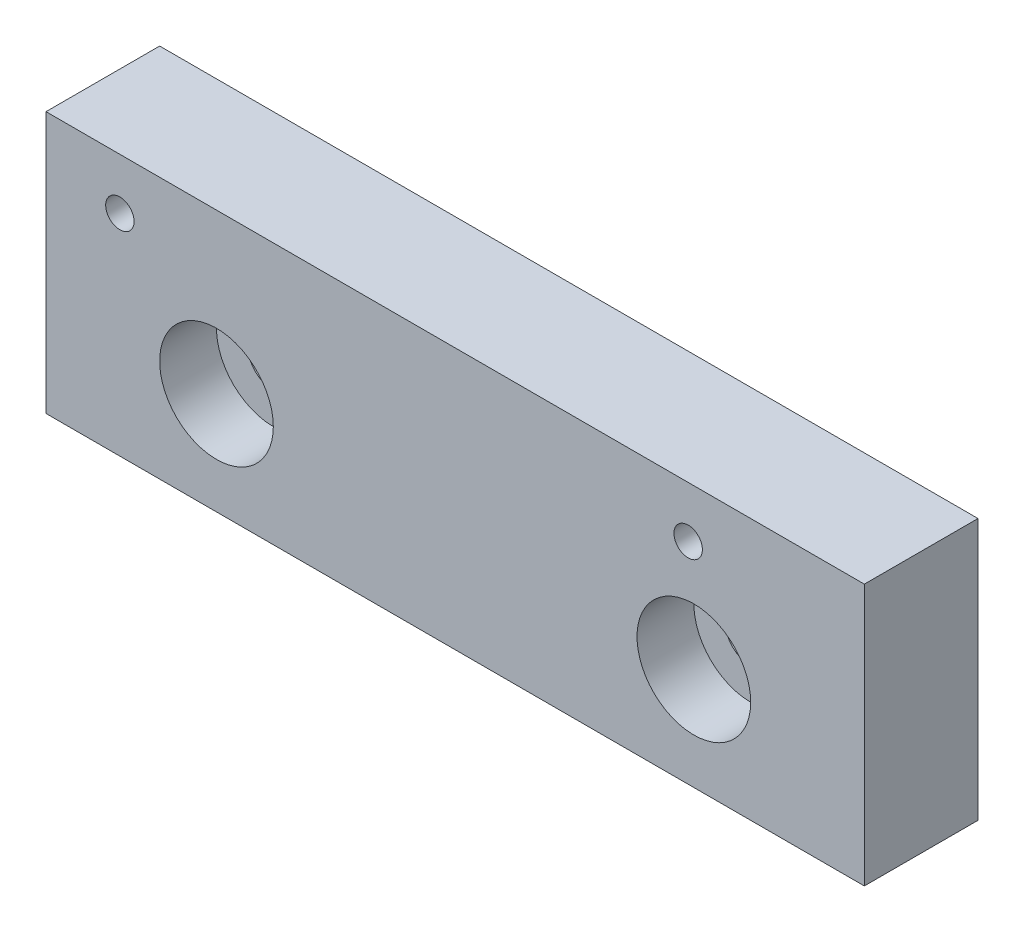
ISO-10303-21;
HEADER;
FILE_DESCRIPTION(('STEP AP214'),'2;1');
FILE_NAME('part.step','',(''),(''),'','','');
FILE_SCHEMA(('AUTOMOTIVE_DESIGN { 1 0 10303 214 1 1 1 1 }'));
ENDSEC;
DATA;
#1=APPLICATION_CONTEXT('core data for automotive mechanical design processes');
#2=APPLICATION_PROTOCOL_DEFINITION('international standard','automotive_design',2000,#1);
#3=PRODUCT_CONTEXT('',#1,'mechanical');
#4=PRODUCT('Part','Part','',(#3));
#5=PRODUCT_RELATED_PRODUCT_CATEGORY('part','',(#4));
#6=PRODUCT_DEFINITION_FORMATION('','',#4);
#7=PRODUCT_DEFINITION_CONTEXT('part definition',#1,'design');
#8=PRODUCT_DEFINITION('design','',#6,#7);
#9=PRODUCT_DEFINITION_SHAPE('','',#8);
#10=(LENGTH_UNIT() NAMED_UNIT(*) SI_UNIT(.MILLI.,.METRE.));
#11=(NAMED_UNIT(*) PLANE_ANGLE_UNIT() SI_UNIT($,.RADIAN.));
#12=(NAMED_UNIT(*) SI_UNIT($,.STERADIAN.) SOLID_ANGLE_UNIT());
#13=UNCERTAINTY_MEASURE_WITH_UNIT(LENGTH_MEASURE(1.E-05),#10,'distance_accuracy_value','');
#14=(GEOMETRIC_REPRESENTATION_CONTEXT(3) GLOBAL_UNCERTAINTY_ASSIGNED_CONTEXT((#13)) GLOBAL_UNIT_ASSIGNED_CONTEXT((#10,
#11,#12)) REPRESENTATION_CONTEXT('',''));
#15=CARTESIAN_POINT('',(0.,0.,0.));
#16=DIRECTION('',(0.,0.,1.));
#17=DIRECTION('',(1.,0.,0.));
#18=AXIS2_PLACEMENT_3D('',#15,#16,#17);
#19=CARTESIAN_POINT('',(20.5,7.,10.));
#20=DIRECTION('',(0.,0.,-1.));
#21=DIRECTION('',(-1.,0.,0.));
#22=AXIS2_PLACEMENT_3D('',#19,#20,#21);
#23=CYLINDRICAL_SURFACE('',#22,1.15);
#24=CARTESIAN_POINT('',(20.5,7.,0.));
#25=DIRECTION('',(0.,0.,1.));
#26=DIRECTION('',(1.,0.,0.));
#27=AXIS2_PLACEMENT_3D('',#24,#25,#26);
#28=CIRCLE('',#27,1.15);
#29=CARTESIAN_POINT('',(21.65,7.,0.));
#30=VERTEX_POINT('',#29);
#31=EDGE_CURVE('E154',#30,#30,#28,.T.);
#32=ORIENTED_EDGE('',*,*,#31,.F.);
#33=EDGE_LOOP('',(#32));
#34=FACE_BOUND('',#33,.T.);
#35=CARTESIAN_POINT('',(20.5,7.,5.));
#36=DIRECTION('',(0.,0.,1.));
#37=DIRECTION('',(1.,0.,0.));
#38=AXIS2_PLACEMENT_3D('',#35,#36,#37);
#39=CIRCLE('',#38,1.15);
#40=CARTESIAN_POINT('',(21.65,7.,5.));
#41=VERTEX_POINT('',#40);
#42=EDGE_CURVE('E42',#41,#41,#39,.T.);
#43=ORIENTED_EDGE('',*,*,#42,.T.);
#44=EDGE_LOOP('',(#43));
#45=FACE_BOUND('',#44,.T.);
#46=ADVANCED_FACE('F38',(#34,#45),#23,.F.);
#47=CARTESIAN_POINT('',(-29.5,7.,10.));
#48=DIRECTION('',(0.,0.,-1.));
#49=DIRECTION('',(-1.,0.,0.));
#50=AXIS2_PLACEMENT_3D('',#47,#48,#49);
#51=CYLINDRICAL_SURFACE('',#50,1.15);
#52=CARTESIAN_POINT('',(-29.5,7.,0.));
#53=DIRECTION('',(0.,0.,1.));
#54=DIRECTION('',(1.,0.,0.));
#55=AXIS2_PLACEMENT_3D('',#52,#53,#54);
#56=CIRCLE('',#55,1.15);
#57=CARTESIAN_POINT('',(-28.35,7.,0.));
#58=VERTEX_POINT('',#57);
#59=EDGE_CURVE('E94',#58,#58,#56,.T.);
#60=ORIENTED_EDGE('',*,*,#59,.F.);
#61=EDGE_LOOP('',(#60));
#62=FACE_BOUND('',#61,.T.);
#63=CARTESIAN_POINT('',(-29.5,7.,5.));
#64=DIRECTION('',(0.,0.,1.));
#65=DIRECTION('',(1.,0.,0.));
#66=AXIS2_PLACEMENT_3D('',#63,#64,#65);
#67=CIRCLE('',#66,1.15);
#68=CARTESIAN_POINT('',(-28.35,7.,5.));
#69=VERTEX_POINT('',#68);
#70=EDGE_CURVE('E126',#69,#69,#67,.T.);
#71=ORIENTED_EDGE('',*,*,#70,.T.);
#72=EDGE_LOOP('',(#71));
#73=FACE_BOUND('',#72,.T.);
#74=ADVANCED_FACE('F160',(#62,#73),#51,.F.);
#75=CARTESIAN_POINT('',(-21.,-2.5,10.));
#76=DIRECTION('',(0.,0.,-1.));
#77=DIRECTION('',(-1.,0.,0.));
#78=AXIS2_PLACEMENT_3D('',#75,#76,#77);
#79=CYLINDRICAL_SURFACE('',#78,2.25);
#80=CARTESIAN_POINT('',(-21.,-2.5,0.));
#81=DIRECTION('',(0.,0.,1.));
#82=DIRECTION('',(1.,0.,0.));
#83=AXIS2_PLACEMENT_3D('',#80,#81,#82);
#84=CIRCLE('',#83,2.25);
#85=CARTESIAN_POINT('',(-18.75,-2.5,0.));
#86=VERTEX_POINT('',#85);
#87=EDGE_CURVE('E151',#86,#86,#84,.T.);
#88=ORIENTED_EDGE('',*,*,#87,.F.);
#89=EDGE_LOOP('',(#88));
#90=FACE_BOUND('',#89,.T.);
#91=CARTESIAN_POINT('',(-21.,-2.5,5.));
#92=DIRECTION('',(0.,0.,1.));
#93=DIRECTION('',(1.,0.,0.));
#94=AXIS2_PLACEMENT_3D('',#91,#92,#93);
#95=CIRCLE('',#94,2.25);
#96=CARTESIAN_POINT('',(-18.75,-2.5,5.));
#97=VERTEX_POINT('',#96);
#98=EDGE_CURVE('E122',#97,#97,#95,.T.);
#99=ORIENTED_EDGE('',*,*,#98,.T.);
#100=EDGE_LOOP('',(#99));
#101=FACE_BOUND('',#100,.T.);
#102=ADVANCED_FACE('F162',(#90,#101),#79,.F.);
#103=CARTESIAN_POINT('',(21.,-2.5,10.));
#104=DIRECTION('',(0.,0.,-1.));
#105=DIRECTION('',(-1.,0.,0.));
#106=AXIS2_PLACEMENT_3D('',#103,#104,#105);
#107=CYLINDRICAL_SURFACE('',#106,2.25);
#108=CARTESIAN_POINT('',(21.,-2.5,0.));
#109=DIRECTION('',(0.,0.,1.));
#110=DIRECTION('',(1.,0.,0.));
#111=AXIS2_PLACEMENT_3D('',#108,#109,#110);
#112=CIRCLE('',#111,2.25);
#113=CARTESIAN_POINT('',(23.25,-2.5,0.));
#114=VERTEX_POINT('',#113);
#115=EDGE_CURVE('E120',#114,#114,#112,.T.);
#116=ORIENTED_EDGE('',*,*,#115,.F.);
#117=EDGE_LOOP('',(#116));
#118=FACE_BOUND('',#117,.T.);
#119=CARTESIAN_POINT('',(21.,-2.5,5.));
#120=DIRECTION('',(0.,0.,1.));
#121=DIRECTION('',(1.,0.,0.));
#122=AXIS2_PLACEMENT_3D('',#119,#120,#121);
#123=CIRCLE('',#122,2.25);
#124=CARTESIAN_POINT('',(23.25,-2.5,5.));
#125=VERTEX_POINT('',#124);
#126=EDGE_CURVE('E117',#125,#125,#123,.T.);
#127=ORIENTED_EDGE('',*,*,#126,.T.);
#128=EDGE_LOOP('',(#127));
#129=FACE_BOUND('',#128,.T.);
#130=ADVANCED_FACE('F168',(#118,#129),#107,.F.);
#131=CARTESIAN_POINT('',(-36.,-11.5,0.));
#132=DIRECTION('',(0.,0.,-1.));
#133=DIRECTION('',(-1.,0.,0.));
#134=AXIS2_PLACEMENT_3D('',#131,#132,#133);
#135=PLANE('',#134);
#136=ORIENTED_EDGE('',*,*,#87,.T.);
#137=EDGE_LOOP('',(#136));
#138=FACE_BOUND('',#137,.T.);
#139=ORIENTED_EDGE('',*,*,#59,.T.);
#140=EDGE_LOOP('',(#139));
#141=FACE_BOUND('',#140,.T.);
#142=DIRECTION('',(0.,-1.,0.));
#143=VECTOR('',#142,1.);
#144=CARTESIAN_POINT('',(-36.,11.5,0.));
#145=LINE('',#144,#143);
#146=CARTESIAN_POINT('',(-36.,11.5,0.));
#147=VERTEX_POINT('',#146);
#148=CARTESIAN_POINT('',(-36.,-11.5,0.));
#149=VERTEX_POINT('',#148);
#150=EDGE_CURVE('E91',#147,#149,#145,.T.);
#151=ORIENTED_EDGE('',*,*,#150,.F.);
#152=DIRECTION('',(1.,0.,0.));
#153=VECTOR('',#152,1.);
#154=CARTESIAN_POINT('',(-36.,11.5,0.));
#155=LINE('',#154,#153);
#156=CARTESIAN_POINT('',(36.,11.5,0.));
#157=VERTEX_POINT('',#156);
#158=EDGE_CURVE('E102',#147,#157,#155,.T.);
#159=ORIENTED_EDGE('',*,*,#158,.T.);
#160=DIRECTION('',(0.,1.,0.));
#161=VECTOR('',#160,1.);
#162=CARTESIAN_POINT('',(36.,-11.5,0.));
#163=LINE('',#162,#161);
#164=CARTESIAN_POINT('',(36.,-11.5,0.));
#165=VERTEX_POINT('',#164);
#166=EDGE_CURVE('E100',#165,#157,#163,.T.);
#167=ORIENTED_EDGE('',*,*,#166,.F.);
#168=DIRECTION('',(-1.,0.,0.));
#169=VECTOR('',#168,1.);
#170=CARTESIAN_POINT('',(36.,-11.5,0.));
#171=LINE('',#170,#169);
#172=EDGE_CURVE('E87',#165,#149,#171,.T.);
#173=ORIENTED_EDGE('',*,*,#172,.T.);
#174=EDGE_LOOP('',(#151,#159,#167,#173));
#175=FACE_BOUND('',#174,.T.);
#176=ORIENTED_EDGE('',*,*,#31,.T.);
#177=EDGE_LOOP('',(#176));
#178=FACE_BOUND('',#177,.T.);
#179=ORIENTED_EDGE('',*,*,#115,.T.);
#180=EDGE_LOOP('',(#179));
#181=FACE_BOUND('',#180,.T.);
#182=ADVANCED_FACE('F97',(#138,#141,#175,#178,#181),#135,.T.);
#183=CARTESIAN_POINT('',(-36.,-11.5,10.));
#184=DIRECTION('',(0.,0.,-1.));
#185=DIRECTION('',(-1.,0.,0.));
#186=AXIS2_PLACEMENT_3D('',#183,#184,#185);
#187=PLANE('',#186);
#188=CARTESIAN_POINT('',(20.5,7.,10.));
#189=DIRECTION('',(0.,0.,1.));
#190=DIRECTION('',(1.,0.,0.));
#191=AXIS2_PLACEMENT_3D('',#188,#189,#190);
#192=CIRCLE('',#191,1.25);
#193=CARTESIAN_POINT('',(21.75,7.,10.));
#194=VERTEX_POINT('',#193);
#195=EDGE_CURVE('E291',#194,#194,#192,.T.);
#196=ORIENTED_EDGE('',*,*,#195,.F.);
#197=EDGE_LOOP('',(#196));
#198=FACE_BOUND('',#197,.T.);
#199=CARTESIAN_POINT('',(-29.5,7.,10.));
#200=DIRECTION('',(0.,0.,1.));
#201=DIRECTION('',(1.,0.,0.));
#202=AXIS2_PLACEMENT_3D('',#199,#200,#201);
#203=CIRCLE('',#202,1.25);
#204=CARTESIAN_POINT('',(-28.25,7.,10.));
#205=VERTEX_POINT('',#204);
#206=EDGE_CURVE('E135',#205,#205,#203,.T.);
#207=ORIENTED_EDGE('',*,*,#206,.F.);
#208=EDGE_LOOP('',(#207));
#209=FACE_BOUND('',#208,.T.);
#210=CARTESIAN_POINT('',(-21.,-2.5,10.));
#211=DIRECTION('',(0.,0.,1.));
#212=DIRECTION('',(1.,0.,0.));
#213=AXIS2_PLACEMENT_3D('',#210,#211,#212);
#214=CIRCLE('',#213,5.);
#215=CARTESIAN_POINT('',(-16.,-2.5,10.));
#216=VERTEX_POINT('',#215);
#217=EDGE_CURVE('E128',#216,#216,#214,.T.);
#218=ORIENTED_EDGE('',*,*,#217,.F.);
#219=EDGE_LOOP('',(#218));
#220=FACE_BOUND('',#219,.T.);
#221=CARTESIAN_POINT('',(21.,-2.5,10.));
#222=DIRECTION('',(0.,0.,1.));
#223=DIRECTION('',(1.,0.,0.));
#224=AXIS2_PLACEMENT_3D('',#221,#222,#223);
#225=CIRCLE('',#224,5.);
#226=CARTESIAN_POINT('',(26.,-2.5,10.));
#227=VERTEX_POINT('',#226);
#228=EDGE_CURVE('E124',#227,#227,#225,.T.);
#229=ORIENTED_EDGE('',*,*,#228,.F.);
#230=EDGE_LOOP('',(#229));
#231=FACE_BOUND('',#230,.T.);
#232=DIRECTION('',(0.,-1.,0.));
#233=VECTOR('',#232,1.);
#234=CARTESIAN_POINT('',(-36.,11.5,10.));
#235=LINE('',#234,#233);
#236=CARTESIAN_POINT('',(-36.,11.5,10.));
#237=VERTEX_POINT('',#236);
#238=CARTESIAN_POINT('',(-36.,-11.5,10.));
#239=VERTEX_POINT('',#238);
#240=EDGE_CURVE('E107',#237,#239,#235,.T.);
#241=ORIENTED_EDGE('',*,*,#240,.T.);
#242=DIRECTION('',(-1.,0.,0.));
#243=VECTOR('',#242,1.);
#244=CARTESIAN_POINT('',(36.,-11.5,10.));
#245=LINE('',#244,#243);
#246=CARTESIAN_POINT('',(36.,-11.5,10.));
#247=VERTEX_POINT('',#246);
#248=EDGE_CURVE('E88',#247,#239,#245,.T.);
#249=ORIENTED_EDGE('',*,*,#248,.F.);
#250=DIRECTION('',(0.,1.,0.));
#251=VECTOR('',#250,1.);
#252=CARTESIAN_POINT('',(36.,-11.5,10.));
#253=LINE('',#252,#251);
#254=CARTESIAN_POINT('',(36.,11.5,10.));
#255=VERTEX_POINT('',#254);
#256=EDGE_CURVE('E63',#247,#255,#253,.T.);
#257=ORIENTED_EDGE('',*,*,#256,.T.);
#258=DIRECTION('',(1.,0.,0.));
#259=VECTOR('',#258,1.);
#260=CARTESIAN_POINT('',(-36.,11.5,10.));
#261=LINE('',#260,#259);
#262=EDGE_CURVE('E111',#237,#255,#261,.T.);
#263=ORIENTED_EDGE('',*,*,#262,.F.);
#264=EDGE_LOOP('',(#241,#249,#257,#263));
#265=FACE_BOUND('',#264,.T.);
#266=ADVANCED_FACE('F176',(#198,#209,#220,#231,#265),#187,.F.);
#267=CARTESIAN_POINT('',(-36.,11.5,10.));
#268=DIRECTION('',(1.,0.,0.));
#269=DIRECTION('',(0.,1.,0.));
#270=AXIS2_PLACEMENT_3D('',#267,#268,#269);
#271=PLANE('',#270);
#272=ORIENTED_EDGE('',*,*,#150,.T.);
#273=DIRECTION('',(0.,0.,-1.));
#274=VECTOR('',#273,1.);
#275=CARTESIAN_POINT('',(-36.,-11.5,10.));
#276=LINE('',#275,#274);
#277=EDGE_CURVE('E12',#239,#149,#276,.T.);
#278=ORIENTED_EDGE('',*,*,#277,.F.);
#279=ORIENTED_EDGE('',*,*,#240,.F.);
#280=DIRECTION('',(0.,0.,-1.));
#281=VECTOR('',#280,1.);
#282=CARTESIAN_POINT('',(-36.,11.5,10.));
#283=LINE('',#282,#281);
#284=EDGE_CURVE('E55',#237,#147,#283,.T.);
#285=ORIENTED_EDGE('',*,*,#284,.T.);
#286=EDGE_LOOP('',(#272,#278,#279,#285));
#287=FACE_BOUND('',#286,.T.);
#288=ADVANCED_FACE('F40',(#287),#271,.F.);
#289=CARTESIAN_POINT('',(36.,-11.5,10.));
#290=DIRECTION('',(0.,-1.,0.));
#291=DIRECTION('',(0.,0.,-1.));
#292=AXIS2_PLACEMENT_3D('',#289,#290,#291);
#293=PLANE('',#292);
#294=ORIENTED_EDGE('',*,*,#172,.F.);
#295=DIRECTION('',(0.,0.,-1.));
#296=VECTOR('',#295,1.);
#297=CARTESIAN_POINT('',(36.,-11.5,10.));
#298=LINE('',#297,#296);
#299=EDGE_CURVE('E47',#247,#165,#298,.T.);
#300=ORIENTED_EDGE('',*,*,#299,.F.);
#301=ORIENTED_EDGE('',*,*,#248,.T.);
#302=ORIENTED_EDGE('',*,*,#277,.T.);
#303=EDGE_LOOP('',(#294,#300,#301,#302));
#304=FACE_BOUND('',#303,.T.);
#305=ADVANCED_FACE('F85',(#304),#293,.T.);
#306=CARTESIAN_POINT('',(36.,-11.5,10.));
#307=DIRECTION('',(-1.,0.,0.));
#308=DIRECTION('',(0.,0.,1.));
#309=AXIS2_PLACEMENT_3D('',#306,#307,#308);
#310=PLANE('',#309);
#311=ORIENTED_EDGE('',*,*,#166,.T.);
#312=DIRECTION('',(0.,0.,-1.));
#313=VECTOR('',#312,1.);
#314=CARTESIAN_POINT('',(36.,11.5,10.));
#315=LINE('',#314,#313);
#316=EDGE_CURVE('E114',#255,#157,#315,.T.);
#317=ORIENTED_EDGE('',*,*,#316,.F.);
#318=ORIENTED_EDGE('',*,*,#256,.F.);
#319=ORIENTED_EDGE('',*,*,#299,.T.);
#320=EDGE_LOOP('',(#311,#317,#318,#319));
#321=FACE_BOUND('',#320,.T.);
#322=ADVANCED_FACE('F185',(#321),#310,.F.);
#323=CARTESIAN_POINT('',(-36.,11.5,10.));
#324=DIRECTION('',(0.,1.,0.));
#325=DIRECTION('',(0.,0.,1.));
#326=AXIS2_PLACEMENT_3D('',#323,#324,#325);
#327=PLANE('',#326);
#328=ORIENTED_EDGE('',*,*,#158,.F.);
#329=ORIENTED_EDGE('',*,*,#284,.F.);
#330=ORIENTED_EDGE('',*,*,#262,.T.);
#331=ORIENTED_EDGE('',*,*,#316,.T.);
#332=EDGE_LOOP('',(#328,#329,#330,#331));
#333=FACE_BOUND('',#332,.T.);
#334=ADVANCED_FACE('F181',(#333),#327,.T.);
#335=CARTESIAN_POINT('',(21.,-2.5,5.));
#336=DIRECTION('',(0.,0.,1.));
#337=DIRECTION('',(1.,0.,0.));
#338=AXIS2_PLACEMENT_3D('',#335,#336,#337);
#339=CYLINDRICAL_SURFACE('',#338,5.);
#340=CARTESIAN_POINT('',(21.,-2.5,5.));
#341=DIRECTION('',(0.,0.,1.));
#342=DIRECTION('',(1.,0.,0.));
#343=AXIS2_PLACEMENT_3D('',#340,#341,#342);
#344=CIRCLE('',#343,5.);
#345=CARTESIAN_POINT('',(26.,-2.5,5.));
#346=VERTEX_POINT('',#345);
#347=EDGE_CURVE('E121',#346,#346,#344,.T.);
#348=ORIENTED_EDGE('',*,*,#347,.F.);
#349=EDGE_LOOP('',(#348));
#350=FACE_BOUND('',#349,.T.);
#351=ORIENTED_EDGE('',*,*,#228,.T.);
#352=EDGE_LOOP('',(#351));
#353=FACE_BOUND('',#352,.T.);
#354=ADVANCED_FACE('F184',(#350,#353),#339,.F.);
#355=CARTESIAN_POINT('',(21.,-2.5,5.));
#356=DIRECTION('',(0.,0.,1.));
#357=DIRECTION('',(1.,0.,0.));
#358=AXIS2_PLACEMENT_3D('',#355,#356,#357);
#359=PLANE('',#358);
#360=ORIENTED_EDGE('',*,*,#126,.F.);
#361=EDGE_LOOP('',(#360));
#362=FACE_BOUND('',#361,.T.);
#363=ORIENTED_EDGE('',*,*,#347,.T.);
#364=EDGE_LOOP('',(#363));
#365=FACE_BOUND('',#364,.T.);
#366=ADVANCED_FACE('F227',(#362,#365),#359,.T.);
#367=CARTESIAN_POINT('',(-21.,-2.5,5.));
#368=DIRECTION('',(0.,0.,1.));
#369=DIRECTION('',(1.,0.,0.));
#370=AXIS2_PLACEMENT_3D('',#367,#368,#369);
#371=CYLINDRICAL_SURFACE('',#370,5.);
#372=CARTESIAN_POINT('',(-21.,-2.5,5.));
#373=DIRECTION('',(0.,0.,1.));
#374=DIRECTION('',(1.,0.,0.));
#375=AXIS2_PLACEMENT_3D('',#372,#373,#374);
#376=CIRCLE('',#375,5.);
#377=CARTESIAN_POINT('',(-16.,-2.5,5.));
#378=VERTEX_POINT('',#377);
#379=EDGE_CURVE('E125',#378,#378,#376,.T.);
#380=ORIENTED_EDGE('',*,*,#379,.F.);
#381=EDGE_LOOP('',(#380));
#382=FACE_BOUND('',#381,.T.);
#383=ORIENTED_EDGE('',*,*,#217,.T.);
#384=EDGE_LOOP('',(#383));
#385=FACE_BOUND('',#384,.T.);
#386=ADVANCED_FACE('F235',(#382,#385),#371,.F.);
#387=CARTESIAN_POINT('',(-21.,-2.5,5.));
#388=DIRECTION('',(0.,0.,1.));
#389=DIRECTION('',(1.,0.,0.));
#390=AXIS2_PLACEMENT_3D('',#387,#388,#389);
#391=PLANE('',#390);
#392=ORIENTED_EDGE('',*,*,#98,.F.);
#393=EDGE_LOOP('',(#392));
#394=FACE_BOUND('',#393,.T.);
#395=ORIENTED_EDGE('',*,*,#379,.T.);
#396=EDGE_LOOP('',(#395));
#397=FACE_BOUND('',#396,.T.);
#398=ADVANCED_FACE('F243',(#394,#397),#391,.T.);
#399=CARTESIAN_POINT('',(-29.5,7.,5.));
#400=DIRECTION('',(0.,0.,1.));
#401=DIRECTION('',(1.,0.,0.));
#402=AXIS2_PLACEMENT_3D('',#399,#400,#401);
#403=CYLINDRICAL_SURFACE('',#402,1.25);
#404=CARTESIAN_POINT('',(-29.5,7.,5.));
#405=DIRECTION('',(0.,0.,1.));
#406=DIRECTION('',(1.,0.,0.));
#407=AXIS2_PLACEMENT_3D('',#404,#405,#406);
#408=CIRCLE('',#407,1.25);
#409=CARTESIAN_POINT('',(-28.25,7.,5.));
#410=VERTEX_POINT('',#409);
#411=EDGE_CURVE('E129',#410,#410,#408,.T.);
#412=ORIENTED_EDGE('',*,*,#411,.F.);
#413=EDGE_LOOP('',(#412));
#414=FACE_BOUND('',#413,.T.);
#415=ORIENTED_EDGE('',*,*,#206,.T.);
#416=EDGE_LOOP('',(#415));
#417=FACE_BOUND('',#416,.T.);
#418=ADVANCED_FACE('F251',(#414,#417),#403,.F.);
#419=CARTESIAN_POINT('',(-29.5,7.,5.));
#420=DIRECTION('',(0.,0.,1.));
#421=DIRECTION('',(1.,0.,0.));
#422=AXIS2_PLACEMENT_3D('',#419,#420,#421);
#423=PLANE('',#422);
#424=ORIENTED_EDGE('',*,*,#70,.F.);
#425=EDGE_LOOP('',(#424));
#426=FACE_BOUND('',#425,.T.);
#427=ORIENTED_EDGE('',*,*,#411,.T.);
#428=EDGE_LOOP('',(#427));
#429=FACE_BOUND('',#428,.T.);
#430=ADVANCED_FACE('F259',(#426,#429),#423,.T.);
#431=CARTESIAN_POINT('',(20.5,7.,5.));
#432=DIRECTION('',(0.,0.,1.));
#433=DIRECTION('',(1.,0.,0.));
#434=AXIS2_PLACEMENT_3D('',#431,#432,#433);
#435=CYLINDRICAL_SURFACE('',#434,1.25);
#436=CARTESIAN_POINT('',(20.5,7.,5.));
#437=DIRECTION('',(0.,0.,1.));
#438=DIRECTION('',(1.,0.,0.));
#439=AXIS2_PLACEMENT_3D('',#436,#437,#438);
#440=CIRCLE('',#439,1.25);
#441=CARTESIAN_POINT('',(21.75,7.,5.));
#442=VERTEX_POINT('',#441);
#443=EDGE_CURVE('E290',#442,#442,#440,.T.);
#444=ORIENTED_EDGE('',*,*,#443,.F.);
#445=EDGE_LOOP('',(#444));
#446=FACE_BOUND('',#445,.T.);
#447=ORIENTED_EDGE('',*,*,#195,.T.);
#448=EDGE_LOOP('',(#447));
#449=FACE_BOUND('',#448,.T.);
#450=ADVANCED_FACE('F267',(#446,#449),#435,.F.);
#451=CARTESIAN_POINT('',(20.5,7.,5.));
#452=DIRECTION('',(0.,0.,1.));
#453=DIRECTION('',(1.,0.,0.));
#454=AXIS2_PLACEMENT_3D('',#451,#452,#453);
#455=PLANE('',#454);
#456=ORIENTED_EDGE('',*,*,#42,.F.);
#457=EDGE_LOOP('',(#456));
#458=FACE_BOUND('',#457,.T.);
#459=ORIENTED_EDGE('',*,*,#443,.T.);
#460=EDGE_LOOP('',(#459));
#461=FACE_BOUND('',#460,.T.);
#462=ADVANCED_FACE('F275',(#458,#461),#455,.T.);
#463=CLOSED_SHELL('',(#46,#74,#102,#130,#182,#266,#288,#305,#322,#334,#354,#366,#386,#398,#418,
#430,#450,#462));
#464=MANIFOLD_SOLID_BREP('B2',#463);
#465=ADVANCED_BREP_SHAPE_REPRESENTATION('',(#18,#464),#14);
#466=SHAPE_DEFINITION_REPRESENTATION(#9,#465);
ENDSEC;
END-ISO-10303-21;
